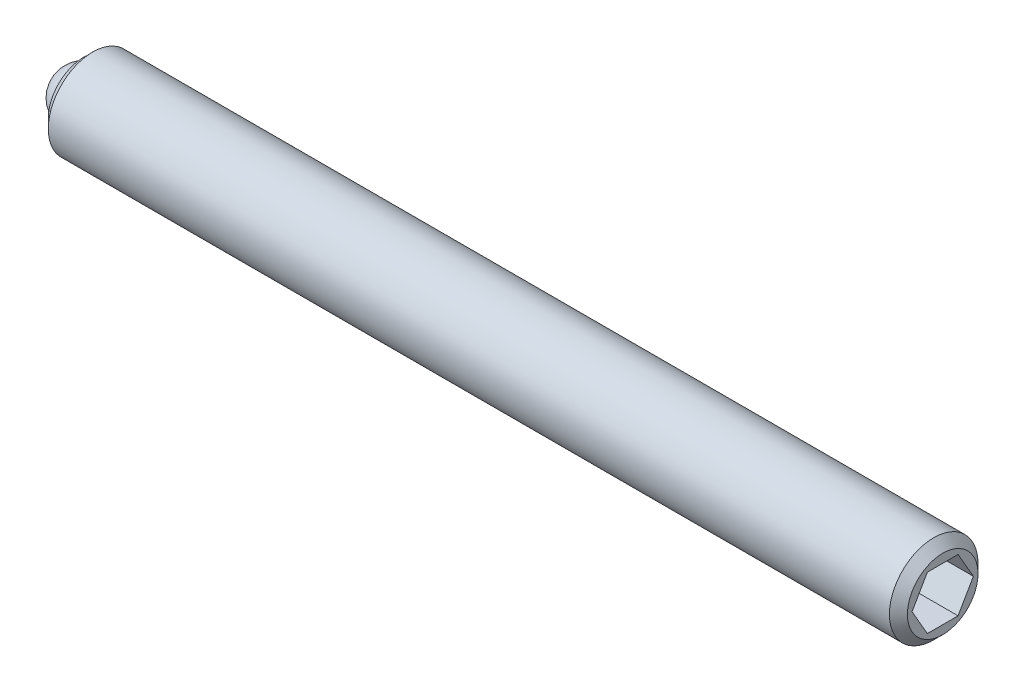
ISO-10303-21;
HEADER;
FILE_DESCRIPTION(('STEP AP214'),'2;1');
FILE_NAME('part.step','',(''),(''),'','','');
FILE_SCHEMA(('AUTOMOTIVE_DESIGN { 1 0 10303 214 1 1 1 1 }'));
ENDSEC;
DATA;
#1=APPLICATION_CONTEXT('core data for automotive mechanical design processes');
#2=APPLICATION_PROTOCOL_DEFINITION('international standard','automotive_design',2000,#1);
#3=PRODUCT_CONTEXT('',#1,'mechanical');
#4=PRODUCT('Part','Part','',(#3));
#5=PRODUCT_RELATED_PRODUCT_CATEGORY('part','',(#4));
#6=PRODUCT_DEFINITION_FORMATION('','',#4);
#7=PRODUCT_DEFINITION_CONTEXT('part definition',#1,'design');
#8=PRODUCT_DEFINITION('design','',#6,#7);
#9=PRODUCT_DEFINITION_SHAPE('','',#8);
#10=(LENGTH_UNIT() NAMED_UNIT(*) SI_UNIT(.MILLI.,.METRE.));
#11=(NAMED_UNIT(*) PLANE_ANGLE_UNIT() SI_UNIT($,.RADIAN.));
#12=(NAMED_UNIT(*) SI_UNIT($,.STERADIAN.) SOLID_ANGLE_UNIT());
#13=UNCERTAINTY_MEASURE_WITH_UNIT(LENGTH_MEASURE(1.E-05),#10,'distance_accuracy_value','');
#14=(GEOMETRIC_REPRESENTATION_CONTEXT(3) GLOBAL_UNCERTAINTY_ASSIGNED_CONTEXT((#13)) GLOBAL_UNIT_ASSIGNED_CONTEXT((#10,
#11,#12)) REPRESENTATION_CONTEXT('',''));
#15=CARTESIAN_POINT('',(0.,0.,0.));
#16=DIRECTION('',(0.,0.,1.));
#17=DIRECTION('',(1.,0.,0.));
#18=AXIS2_PLACEMENT_3D('',#15,#16,#17);
#19=CARTESIAN_POINT('',(0.,0.,0.));
#20=DIRECTION('',(0.,-1.,0.));
#21=DIRECTION('',(0.,0.,-1.));
#22=AXIS2_PLACEMENT_3D('',#19,#20,#21);
#23=SPHERICAL_SURFACE('',#22,0.75);
#24=CARTESIAN_POINT('',(0.,-0.75,0.));
#25=VERTEX_POINT('',#24);
#26=VERTEX_LOOP('',#25);
#27=FACE_BOUND('',#26,.T.);
#28=ADVANCED_FACE('F43',(#27),#23,.T.);
#29=CLOSED_SHELL('',(#28));
#30=MANIFOLD_SOLID_BREP('B2',#29);
#31=CARTESIAN_POINT('',(24.25,0.,0.));
#32=DIRECTION('',(-1.,0.,0.));
#33=DIRECTION('',(0.,0.,1.));
#34=AXIS2_PLACEMENT_3D('',#31,#32,#33);
#35=CYLINDRICAL_SURFACE('',#34,1.25);
#36=CARTESIAN_POINT('',(23.996,0.,0.));
#37=DIRECTION('',(1.,0.,0.));
#38=DIRECTION('',(0.,0.,-1.));
#39=AXIS2_PLACEMENT_3D('',#36,#37,#38);
#40=CIRCLE('',#39,1.25);
#41=CARTESIAN_POINT('',(23.996,0.,1.25));
#42=VERTEX_POINT('',#41);
#43=EDGE_CURVE('E41',#42,#42,#40,.F.);
#44=CARTESIAN_POINT('',(0.254000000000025,0.,0.));
#45=DIRECTION('',(1.,0.,0.));
#46=DIRECTION('',(0.,0.,-1.));
#47=AXIS2_PLACEMENT_3D('',#44,#45,#46);
#48=CIRCLE('',#47,1.25);
#49=CARTESIAN_POINT('',(0.254000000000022,0.,1.25));
#50=VERTEX_POINT('',#49);
#51=EDGE_CURVE('E159',#50,#50,#48,.T.);
#52=CARTESIAN_POINT('',(23.996,0.,1.25));
#53=CARTESIAN_POINT('',(23.7486875,0.,1.25));
#54=CARTESIAN_POINT('',(23.501375,0.,1.25));
#55=CARTESIAN_POINT('',(23.00675,0.,1.25));
#56=CARTESIAN_POINT('',(22.7594375,0.,1.25));
#57=CARTESIAN_POINT('',(22.2648125,0.,1.25));
#58=CARTESIAN_POINT('',(22.0175,0.,1.25));
#59=CARTESIAN_POINT('',(21.522875,0.,1.25));
#60=CARTESIAN_POINT('',(21.2755625,0.,1.25));
#61=CARTESIAN_POINT('',(20.7809375,0.,1.25));
#62=CARTESIAN_POINT('',(20.533625,0.,1.25));
#63=CARTESIAN_POINT('',(20.039,0.,1.25));
#64=CARTESIAN_POINT('',(19.7916875,0.,1.25));
#65=CARTESIAN_POINT('',(19.2970625,0.,1.25));
#66=CARTESIAN_POINT('',(19.04975,0.,1.25));
#67=CARTESIAN_POINT('',(18.555125,0.,1.25));
#68=CARTESIAN_POINT('',(18.3078125,0.,1.25));
#69=CARTESIAN_POINT('',(17.8131875,0.,1.25));
#70=CARTESIAN_POINT('',(17.565875,0.,1.25));
#71=CARTESIAN_POINT('',(17.07125,0.,1.25));
#72=CARTESIAN_POINT('',(16.8239375,0.,1.25));
#73=CARTESIAN_POINT('',(16.3293125,0.,1.25));
#74=CARTESIAN_POINT('',(16.082,0.,1.25));
#75=CARTESIAN_POINT('',(15.587375,0.,1.25));
#76=CARTESIAN_POINT('',(15.3400625,0.,1.25));
#77=CARTESIAN_POINT('',(14.8454375,0.,1.25));
#78=CARTESIAN_POINT('',(14.598125,0.,1.25));
#79=CARTESIAN_POINT('',(14.1035,0.,1.25));
#80=CARTESIAN_POINT('',(13.8561875,0.,1.25));
#81=CARTESIAN_POINT('',(13.3615625,0.,1.25));
#82=CARTESIAN_POINT('',(13.11425,0.,1.25));
#83=CARTESIAN_POINT('',(12.619625,0.,1.25));
#84=CARTESIAN_POINT('',(12.3723125,0.,1.25));
#85=CARTESIAN_POINT('',(11.8776875,0.,1.25));
#86=CARTESIAN_POINT('',(11.630375,0.,1.25));
#87=CARTESIAN_POINT('',(11.13575,0.,1.25));
#88=CARTESIAN_POINT('',(10.8884375,0.,1.25));
#89=CARTESIAN_POINT('',(10.3938125,0.,1.25));
#90=CARTESIAN_POINT('',(10.1465,0.,1.25));
#91=CARTESIAN_POINT('',(9.65187500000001,0.,1.25));
#92=CARTESIAN_POINT('',(9.40456250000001,0.,1.25));
#93=CARTESIAN_POINT('',(8.90993750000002,0.,1.25));
#94=CARTESIAN_POINT('',(8.66262500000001,0.,1.25));
#95=CARTESIAN_POINT('',(8.16800000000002,0.,1.25));
#96=CARTESIAN_POINT('',(7.92068750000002,0.,1.25));
#97=CARTESIAN_POINT('',(7.42606250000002,0.,1.25));
#98=CARTESIAN_POINT('',(7.17875000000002,0.,1.25));
#99=CARTESIAN_POINT('',(6.68412500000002,0.,1.25));
#100=CARTESIAN_POINT('',(6.43681250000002,0.,1.25));
#101=CARTESIAN_POINT('',(5.94218750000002,0.,1.25));
#102=CARTESIAN_POINT('',(5.69487500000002,0.,1.25));
#103=CARTESIAN_POINT('',(5.20025000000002,0.,1.25));
#104=CARTESIAN_POINT('',(4.95293750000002,0.,1.25));
#105=CARTESIAN_POINT('',(4.45831250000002,0.,1.25));
#106=CARTESIAN_POINT('',(4.21100000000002,0.,1.25));
#107=CARTESIAN_POINT('',(3.71637500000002,0.,1.25));
#108=CARTESIAN_POINT('',(3.46906250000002,0.,1.25));
#109=CARTESIAN_POINT('',(2.97443750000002,0.,1.25));
#110=CARTESIAN_POINT('',(2.72712500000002,0.,1.25));
#111=CARTESIAN_POINT('',(2.23250000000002,0.,1.25));
#112=CARTESIAN_POINT('',(1.98518750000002,0.,1.25));
#113=CARTESIAN_POINT('',(1.49056250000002,0.,1.25));
#114=CARTESIAN_POINT('',(1.24325000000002,0.,1.25));
#115=CARTESIAN_POINT('',(0.74862500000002,0.,1.25));
#116=CARTESIAN_POINT('',(0.501312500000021,0.,1.25));
#117=CARTESIAN_POINT('',(0.254000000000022,0.,1.25));
#118=B_SPLINE_CURVE_WITH_KNOTS('',3,(#52,#53,#54,#55,#56,#57,#58,#59,#60,#61,#62,#63,#64,#65,
#66,#67,#68,#69,#70,#71,#72,#73,#74,#75,#76,#77,#78,#79,#80,#81,#82,#83,#84,#85,#86,#87,#88,#89,
#90,#91,#92,#93,#94,#95,#96,#97,#98,#99,#100,#101,#102,#103,#104,#105,#106,#107,#108,#109,#110,
#111,#112,#113,#114,#115,#116,#117),.UNSPECIFIED.,.F.,.F.,(4,2,2,2,2,2,2,2,2,2,2,2,2,2,2,2,2,2,
2,2,2,2,2,2,2,2,2,2,2,2,2,2,4),(0.,0.741937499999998,1.483875,2.2258125,2.96774999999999,
3.7096875,4.45162499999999,5.1935625,5.93549999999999,6.67743749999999,7.41937499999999,
8.16131249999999,8.90324999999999,9.64518749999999,10.387125,11.1290625,11.871,12.6129375,
13.354875,14.0968125,14.83875,15.5806875,16.322625,17.0645625,17.8065,18.5484375,19.290375,
20.0323125,20.77425,21.5161875,22.258125,23.0000625,23.742),.UNSPECIFIED.);
#119=EDGE_CURVE('BSEAM56',#42,#50,#118,.T.);
#120=ORIENTED_EDGE('',*,*,#43,.T.);
#121=ORIENTED_EDGE('',*,*,#51,.T.);
#122=ORIENTED_EDGE('',*,*,#119,.T.);
#123=ORIENTED_EDGE('',*,*,#119,.F.);
#124=EDGE_LOOP('',(#120,#122,#121,#123));
#125=FACE_BOUND('',#124,.T.);
#126=ADVANCED_FACE('F56',(#125),#35,.T.);
#127=CARTESIAN_POINT('',(24.25,0.,0.));
#128=DIRECTION('',(1.,0.,0.));
#129=DIRECTION('',(0.,0.,-1.));
#130=AXIS2_PLACEMENT_3D('',#127,#128,#129);
#131=PLANE('',#130);
#132=DIRECTION('',(0.,0.866025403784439,-0.5));
#133=VECTOR('',#132,1.);
#134=CARTESIAN_POINT('',(24.25,-0.75,-0.43301270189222));
#135=LINE('',#134,#133);
#136=CARTESIAN_POINT('',(24.25,-0.75,-0.43301270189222));
#137=VERTEX_POINT('',#136);
#138=CARTESIAN_POINT('',(24.25,0.,-0.866025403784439));
#139=VERTEX_POINT('',#138);
#140=EDGE_CURVE('E71',#137,#139,#135,.T.);
#141=ORIENTED_EDGE('',*,*,#140,.F.);
#142=DIRECTION('',(0.,0.,-1.));
#143=VECTOR('',#142,1.);
#144=CARTESIAN_POINT('',(24.25,-0.75,0.433012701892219));
#145=LINE('',#144,#143);
#146=CARTESIAN_POINT('',(24.25,-0.75,0.433012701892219));
#147=VERTEX_POINT('',#146);
#148=EDGE_CURVE('E155',#147,#137,#145,.T.);
#149=ORIENTED_EDGE('',*,*,#148,.F.);
#150=DIRECTION('',(0.,-0.866025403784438,-0.5));
#151=VECTOR('',#150,1.);
#152=CARTESIAN_POINT('',(24.25,0.,0.866025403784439));
#153=LINE('',#152,#151);
#154=CARTESIAN_POINT('',(24.25,0.,0.866025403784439));
#155=VERTEX_POINT('',#154);
#156=EDGE_CURVE('E153',#155,#147,#153,.T.);
#157=ORIENTED_EDGE('',*,*,#156,.F.);
#158=DIRECTION('',(0.,-0.866025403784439,0.5));
#159=VECTOR('',#158,1.);
#160=CARTESIAN_POINT('',(24.25,0.75,0.433012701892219));
#161=LINE('',#160,#159);
#162=CARTESIAN_POINT('',(24.25,0.75,0.433012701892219));
#163=VERTEX_POINT('',#162);
#164=EDGE_CURVE('E119',#163,#155,#161,.T.);
#165=ORIENTED_EDGE('',*,*,#164,.F.);
#166=DIRECTION('',(0.,0.,1.));
#167=VECTOR('',#166,1.);
#168=CARTESIAN_POINT('',(24.25,0.75,-0.433012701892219));
#169=LINE('',#168,#167);
#170=CARTESIAN_POINT('',(24.25,0.75,-0.433012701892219));
#171=VERTEX_POINT('',#170);
#172=EDGE_CURVE('E149',#171,#163,#169,.T.);
#173=ORIENTED_EDGE('',*,*,#172,.F.);
#174=DIRECTION('',(0.,0.866025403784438,0.5));
#175=VECTOR('',#174,1.);
#176=CARTESIAN_POINT('',(24.25,0.,-0.866025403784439));
#177=LINE('',#176,#175);
#178=EDGE_CURVE('E145',#139,#171,#177,.T.);
#179=ORIENTED_EDGE('',*,*,#178,.F.);
#180=EDGE_LOOP('',(#141,#149,#157,#165,#173,#179));
#181=FACE_BOUND('',#180,.T.);
#182=CARTESIAN_POINT('',(24.25,0.,0.));
#183=DIRECTION('',(1.,0.,0.));
#184=DIRECTION('',(0.,0.,-1.));
#185=AXIS2_PLACEMENT_3D('',#182,#183,#184);
#186=CIRCLE('',#185,0.996000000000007);
#187=CARTESIAN_POINT('',(24.25,0.,-0.996000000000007));
#188=VERTEX_POINT('',#187);
#189=EDGE_CURVE('E64',#188,#188,#186,.T.);
#190=ORIENTED_EDGE('',*,*,#189,.T.);
#191=EDGE_LOOP('',(#190));
#192=FACE_BOUND('',#191,.T.);
#193=ADVANCED_FACE('F172',(#181,#192),#131,.T.);
#194=CARTESIAN_POINT('',(0.,0.,0.));
#195=DIRECTION('',(1.,0.,0.));
#196=DIRECTION('',(0.,0.,-1.));
#197=AXIS2_PLACEMENT_3D('',#194,#195,#196);
#198=PLANE('',#197);
#199=CARTESIAN_POINT('',(0.,0.,0.));
#200=DIRECTION('',(-1.,0.,0.));
#201=DIRECTION('',(0.,0.,1.));
#202=AXIS2_PLACEMENT_3D('',#199,#200,#201);
#203=CIRCLE('',#202,0.75);
#204=CARTESIAN_POINT('',(0.,0.,0.75));
#205=VERTEX_POINT('',#204);
#206=EDGE_CURVE('E227',#205,#205,#203,.T.);
#207=ORIENTED_EDGE('',*,*,#206,.F.);
#208=EDGE_LOOP('',(#207));
#209=FACE_BOUND('',#208,.T.);
#210=CARTESIAN_POINT('',(0.,0.,0.));
#211=DIRECTION('',(1.,0.,0.));
#212=DIRECTION('',(0.,0.,-1.));
#213=AXIS2_PLACEMENT_3D('',#210,#211,#212);
#214=CIRCLE('',#213,0.995999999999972);
#215=CARTESIAN_POINT('',(0.,0.,-0.995999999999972));
#216=VERTEX_POINT('',#215);
#217=EDGE_CURVE('E167',#216,#216,#214,.F.);
#218=ORIENTED_EDGE('',*,*,#217,.T.);
#219=EDGE_LOOP('',(#218));
#220=FACE_BOUND('',#219,.T.);
#221=ADVANCED_FACE('F184',(#209,#220),#198,.F.);
#222=CARTESIAN_POINT('',(0.254000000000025,0.,0.));
#223=DIRECTION('',(1.,0.,0.));
#224=DIRECTION('',(0.,0.,-1.));
#225=AXIS2_PLACEMENT_3D('',#222,#223,#224);
#226=CONICAL_SURFACE('',#225,1.25,0.785398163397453);
#227=ORIENTED_EDGE('',*,*,#217,.F.);
#228=EDGE_LOOP('',(#227));
#229=FACE_BOUND('',#228,.T.);
#230=ORIENTED_EDGE('',*,*,#51,.F.);
#231=EDGE_LOOP('',(#230));
#232=FACE_BOUND('',#231,.T.);
#233=ADVANCED_FACE('F176',(#229,#232),#226,.T.);
#234=CARTESIAN_POINT('',(24.25,0.,0.));
#235=DIRECTION('',(-1.,0.,0.));
#236=DIRECTION('',(0.,0.,1.));
#237=AXIS2_PLACEMENT_3D('',#234,#235,#236);
#238=CONICAL_SURFACE('',#237,0.996000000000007,0.78539816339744);
#239=ORIENTED_EDGE('',*,*,#43,.F.);
#240=EDGE_LOOP('',(#239));
#241=FACE_BOUND('',#240,.T.);
#242=ORIENTED_EDGE('',*,*,#189,.F.);
#243=EDGE_LOOP('',(#242));
#244=FACE_BOUND('',#243,.T.);
#245=ADVANCED_FACE('F58',(#241,#244),#238,.T.);
#246=CARTESIAN_POINT('',(22.25,-0.75,-0.43301270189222));
#247=DIRECTION('',(0.,-0.5,-0.866025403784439));
#248=DIRECTION('',(0.,0.866025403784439,-0.5));
#249=AXIS2_PLACEMENT_3D('',#246,#247,#248);
#250=PLANE('',#249);
#251=ORIENTED_EDGE('',*,*,#140,.T.);
#252=DIRECTION('',(1.,0.,0.));
#253=VECTOR('',#252,1.);
#254=CARTESIAN_POINT('',(22.25,0.,-0.866025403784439));
#255=LINE('',#254,#253);
#256=CARTESIAN_POINT('',(22.25,0.,-0.866025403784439));
#257=VERTEX_POINT('',#256);
#258=EDGE_CURVE('E101',#257,#139,#255,.T.);
#259=ORIENTED_EDGE('',*,*,#258,.F.);
#260=DIRECTION('',(0.,0.866025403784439,-0.5));
#261=VECTOR('',#260,1.);
#262=CARTESIAN_POINT('',(22.25,-0.75,-0.43301270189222));
#263=LINE('',#262,#261);
#264=CARTESIAN_POINT('',(22.25,-0.75,-0.43301270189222));
#265=VERTEX_POINT('',#264);
#266=EDGE_CURVE('E157',#265,#257,#263,.T.);
#267=ORIENTED_EDGE('',*,*,#266,.F.);
#268=DIRECTION('',(1.,0.,0.));
#269=VECTOR('',#268,1.);
#270=CARTESIAN_POINT('',(22.25,-0.75,-0.43301270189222));
#271=LINE('',#270,#269);
#272=EDGE_CURVE('E79',#265,#137,#271,.T.);
#273=ORIENTED_EDGE('',*,*,#272,.T.);
#274=EDGE_LOOP('',(#251,#259,#267,#273));
#275=FACE_BOUND('',#274,.T.);
#276=ADVANCED_FACE('F175',(#275),#250,.F.);
#277=CARTESIAN_POINT('',(22.25,-0.75,0.433012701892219));
#278=DIRECTION('',(0.,-1.,0.));
#279=DIRECTION('',(0.,0.,-1.));
#280=AXIS2_PLACEMENT_3D('',#277,#278,#279);
#281=PLANE('',#280);
#282=ORIENTED_EDGE('',*,*,#148,.T.);
#283=ORIENTED_EDGE('',*,*,#272,.F.);
#284=DIRECTION('',(0.,0.,-1.));
#285=VECTOR('',#284,1.);
#286=CARTESIAN_POINT('',(22.25,-0.75,0.433012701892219));
#287=LINE('',#286,#285);
#288=CARTESIAN_POINT('',(22.25,-0.75,0.433012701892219));
#289=VERTEX_POINT('',#288);
#290=EDGE_CURVE('E131',#289,#265,#287,.T.);
#291=ORIENTED_EDGE('',*,*,#290,.F.);
#292=DIRECTION('',(1.,0.,0.));
#293=VECTOR('',#292,1.);
#294=CARTESIAN_POINT('',(22.25,-0.75,0.433012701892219));
#295=LINE('',#294,#293);
#296=EDGE_CURVE('E123',#289,#147,#295,.T.);
#297=ORIENTED_EDGE('',*,*,#296,.T.);
#298=EDGE_LOOP('',(#282,#283,#291,#297));
#299=FACE_BOUND('',#298,.T.);
#300=ADVANCED_FACE('F182',(#299),#281,.F.);
#301=CARTESIAN_POINT('',(22.25,0.,0.866025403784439));
#302=DIRECTION('',(0.,-0.5,0.866025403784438));
#303=DIRECTION('',(0.,-0.866025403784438,-0.5));
#304=AXIS2_PLACEMENT_3D('',#301,#302,#303);
#305=PLANE('',#304);
#306=ORIENTED_EDGE('',*,*,#156,.T.);
#307=ORIENTED_EDGE('',*,*,#296,.F.);
#308=DIRECTION('',(0.,-0.866025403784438,-0.5));
#309=VECTOR('',#308,1.);
#310=CARTESIAN_POINT('',(22.25,0.,0.866025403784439));
#311=LINE('',#310,#309);
#312=CARTESIAN_POINT('',(22.25,0.,0.866025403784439));
#313=VERTEX_POINT('',#312);
#314=EDGE_CURVE('E127',#313,#289,#311,.T.);
#315=ORIENTED_EDGE('',*,*,#314,.F.);
#316=DIRECTION('',(1.,0.,0.));
#317=VECTOR('',#316,1.);
#318=CARTESIAN_POINT('',(22.25,0.,0.866025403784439));
#319=LINE('',#318,#317);
#320=EDGE_CURVE('E112',#313,#155,#319,.T.);
#321=ORIENTED_EDGE('',*,*,#320,.T.);
#322=EDGE_LOOP('',(#306,#307,#315,#321));
#323=FACE_BOUND('',#322,.T.);
#324=ADVANCED_FACE('F128',(#323),#305,.F.);
#325=CARTESIAN_POINT('',(22.25,0.75,0.433012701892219));
#326=DIRECTION('',(0.,0.5,0.866025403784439));
#327=DIRECTION('',(0.,-0.866025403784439,0.5));
#328=AXIS2_PLACEMENT_3D('',#325,#326,#327);
#329=PLANE('',#328);
#330=ORIENTED_EDGE('',*,*,#164,.T.);
#331=ORIENTED_EDGE('',*,*,#320,.F.);
#332=DIRECTION('',(0.,-0.866025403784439,0.5));
#333=VECTOR('',#332,1.);
#334=CARTESIAN_POINT('',(22.25,0.75,0.433012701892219));
#335=LINE('',#334,#333);
#336=CARTESIAN_POINT('',(22.25,0.75,0.433012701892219));
#337=VERTEX_POINT('',#336);
#338=EDGE_CURVE('E116',#337,#313,#335,.T.);
#339=ORIENTED_EDGE('',*,*,#338,.F.);
#340=DIRECTION('',(1.,0.,0.));
#341=VECTOR('',#340,1.);
#342=CARTESIAN_POINT('',(22.25,0.75,0.433012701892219));
#343=LINE('',#342,#341);
#344=EDGE_CURVE('E124',#337,#163,#343,.T.);
#345=ORIENTED_EDGE('',*,*,#344,.T.);
#346=EDGE_LOOP('',(#330,#331,#339,#345));
#347=FACE_BOUND('',#346,.T.);
#348=ADVANCED_FACE('F114',(#347),#329,.F.);
#349=CARTESIAN_POINT('',(22.25,0.75,-0.433012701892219));
#350=DIRECTION('',(0.,1.,0.));
#351=DIRECTION('',(0.,0.,1.));
#352=AXIS2_PLACEMENT_3D('',#349,#350,#351);
#353=PLANE('',#352);
#354=ORIENTED_EDGE('',*,*,#172,.T.);
#355=ORIENTED_EDGE('',*,*,#344,.F.);
#356=DIRECTION('',(0.,0.,1.));
#357=VECTOR('',#356,1.);
#358=CARTESIAN_POINT('',(22.25,0.75,-0.433012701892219));
#359=LINE('',#358,#357);
#360=CARTESIAN_POINT('',(22.25,0.75,-0.433012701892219));
#361=VERTEX_POINT('',#360);
#362=EDGE_CURVE('E137',#361,#337,#359,.T.);
#363=ORIENTED_EDGE('',*,*,#362,.F.);
#364=DIRECTION('',(1.,0.,0.));
#365=VECTOR('',#364,1.);
#366=CARTESIAN_POINT('',(22.25,0.75,-0.433012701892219));
#367=LINE('',#366,#365);
#368=EDGE_CURVE('E162',#361,#171,#367,.T.);
#369=ORIENTED_EDGE('',*,*,#368,.T.);
#370=EDGE_LOOP('',(#354,#355,#363,#369));
#371=FACE_BOUND('',#370,.T.);
#372=ADVANCED_FACE('F203',(#371),#353,.F.);
#373=CARTESIAN_POINT('',(22.25,0.,-0.866025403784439));
#374=DIRECTION('',(0.,0.500000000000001,-0.866025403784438));
#375=DIRECTION('',(0.,0.866025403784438,0.500000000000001));
#376=AXIS2_PLACEMENT_3D('',#373,#374,#375);
#377=PLANE('',#376);
#378=ORIENTED_EDGE('',*,*,#178,.T.);
#379=ORIENTED_EDGE('',*,*,#368,.F.);
#380=DIRECTION('',(0.,0.866025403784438,0.5));
#381=VECTOR('',#380,1.);
#382=CARTESIAN_POINT('',(22.25,0.,-0.866025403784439));
#383=LINE('',#382,#381);
#384=EDGE_CURVE('E139',#257,#361,#383,.T.);
#385=ORIENTED_EDGE('',*,*,#384,.F.);
#386=ORIENTED_EDGE('',*,*,#258,.T.);
#387=EDGE_LOOP('',(#378,#379,#385,#386));
#388=FACE_BOUND('',#387,.T.);
#389=ADVANCED_FACE('F200',(#388),#377,.F.);
#390=CARTESIAN_POINT('',(22.25,0.,0.));
#391=DIRECTION('',(1.,0.,0.));
#392=DIRECTION('',(0.,0.,-1.));
#393=AXIS2_PLACEMENT_3D('',#390,#391,#392);
#394=PLANE('',#393);
#395=ORIENTED_EDGE('',*,*,#266,.T.);
#396=ORIENTED_EDGE('',*,*,#384,.T.);
#397=ORIENTED_EDGE('',*,*,#362,.T.);
#398=ORIENTED_EDGE('',*,*,#338,.T.);
#399=ORIENTED_EDGE('',*,*,#314,.T.);
#400=ORIENTED_EDGE('',*,*,#290,.T.);
#401=EDGE_LOOP('',(#395,#396,#397,#398,#399,#400));
#402=FACE_BOUND('',#401,.T.);
#403=ADVANCED_FACE('F134',(#402),#394,.T.);
#404=CARTESIAN_POINT('',(0.8,0.,0.));
#405=DIRECTION('',(-1.,0.,0.));
#406=DIRECTION('',(0.,0.,1.));
#407=AXIS2_PLACEMENT_3D('',#404,#405,#406);
#408=CYLINDRICAL_SURFACE('',#407,0.75);
#409=CARTESIAN_POINT('',(0.8,0.,0.));
#410=DIRECTION('',(-1.,0.,0.));
#411=DIRECTION('',(0.,0.,1.));
#412=AXIS2_PLACEMENT_3D('',#409,#410,#411);
#413=CIRCLE('',#412,0.75);
#414=CARTESIAN_POINT('',(0.8,0.,0.75));
#415=VERTEX_POINT('',#414);
#416=EDGE_CURVE('E146',#415,#415,#413,.T.);
#417=ORIENTED_EDGE('',*,*,#416,.F.);
#418=EDGE_LOOP('',(#417));
#419=FACE_BOUND('',#418,.T.);
#420=ORIENTED_EDGE('',*,*,#206,.T.);
#421=EDGE_LOOP('',(#420));
#422=FACE_BOUND('',#421,.T.);
#423=ADVANCED_FACE('F216',(#419,#422),#408,.F.);
#424=CARTESIAN_POINT('',(0.8,0.,0.));
#425=DIRECTION('',(-1.,0.,0.));
#426=DIRECTION('',(0.,0.,1.));
#427=AXIS2_PLACEMENT_3D('',#424,#425,#426);
#428=PLANE('',#427);
#429=ORIENTED_EDGE('',*,*,#416,.T.);
#430=EDGE_LOOP('',(#429));
#431=FACE_BOUND('',#430,.T.);
#432=ADVANCED_FACE('F219',(#431),#428,.T.);
#433=CLOSED_SHELL('',(#126,#193,#221,#233,#245,#276,#300,#324,#348,#372,#389,#403,#423,#432));
#434=MANIFOLD_SOLID_BREP('B6',#433);
#435=ADVANCED_BREP_SHAPE_REPRESENTATION('',(#18,#30,#434),#14);
#436=SHAPE_DEFINITION_REPRESENTATION(#9,#435);
ENDSEC;
END-ISO-10303-21;
